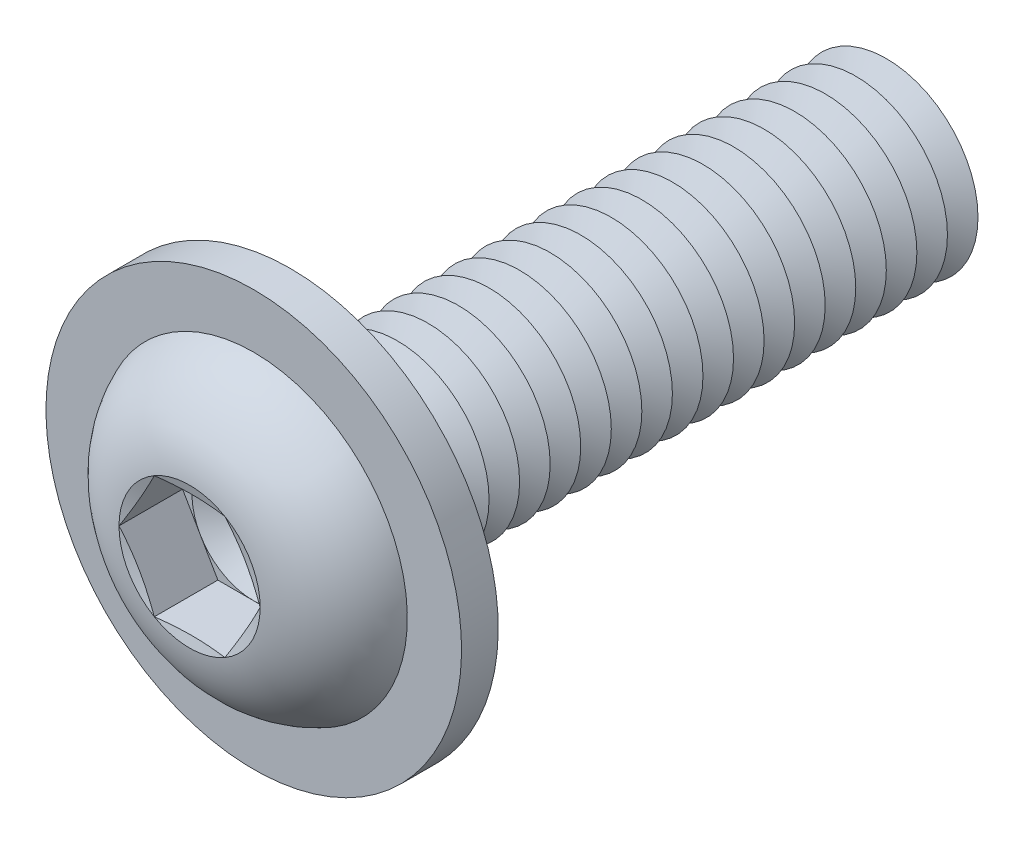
from build123d import *

# Parameters (mm, degrees)
FILLET1_R           = 0.5
LPATTERN1_COUNT     = 20
LPATTERN1_PITCH     = 1
CUT_EXTRUDE1_DEPTH  = 2.08
SKETCH5_R           = 6.8
SKETCH5_R_2         = 3.5
BOSS_EXTRUDE1_DEPTH = 1.2


with BuildPart() as part:
    # Sketch1 → Revolve1 (revolve)
    with BuildSketch(Plane(origin=(0, 0, 0), x_dir=(0, 0, -1), z_dir=(1, 0, 0)), mode=Mode.PRIVATE) as revolve1_sk:
        with BuildLine():
            Line((0, 3), (0, 5.25))
            ThreePointArc((0, 5.25), (-2.210041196, 4.408189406), (-3.3, 2.3094))
            Line((-3.3, 2.3094), (-2.990599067, 1.1547))
            Line((-2.990599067, 1.1547), (-3.3, 1.1547))
            Line((-3.3, 1.1547), (-3.3, 0))
            Line((-3.3, 0), (20, 0))
            Line((20, 0), (20, 3))
            Line((20, 3), (0, 3))
        make_face()
    revolve(revolve1_sk.sketch.rotate(Axis((0, 0, -20), (0, 0, 1)), 90), axis=Axis((0, 0, -20), (0, 0, 1)))

    # Fillet1
    fillet1_edges = [part.edges().sort_by_distance(p)[0] for p in [
        (3, 0, 0),
    ]]
    fillet(fillet1_edges, radius=FILLET1_R)

    # Sketch2 → Cut-Revolve1 (revolve, cut)
    with BuildSketch(Plane(origin=(0, 0, 0), x_dir=(0, 0, -1), z_dir=(1, 0, 0)), mode=Mode.PRIVATE) as cut_revolve1_sk:
        Polygon((19.5, 3), (20.5, 3), (20, 2.133974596), align=None)
    cut_revolve1 = revolve(cut_revolve1_sk.sketch.rotate(Axis((0, 0, -20), (0, 0, -1)), 270), axis=Axis((0, 0, -20), (0, 0, -1)), mode=Mode.SUBTRACT)

    # LPattern1: Cut-Revolve1 ×20
    with Locations(*[(0, 0, i * LPATTERN1_PITCH) for i in range(1, LPATTERN1_COUNT)]):
        add(cut_revolve1, mode=Mode.SUBTRACT)

    # Sketch3 → Cut-Extrude1 (cut)
    with BuildSketch(Plane.XY.offset(3.3)):
        Polygon((1.1547, 1.999999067), (-1.1547, 1.999999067), (-2.3094, 0), (-1.1547, -1.999999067), (1.1547, -1.999999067), (2.3094, 0), align=None)
    extrude(amount=-CUT_EXTRUDE1_DEPTH, mode=Mode.SUBTRACT)

    # Cut-Extrude2 cone 1 section (on through the dimple's axis) → Cut-Extrude2 (revolve, cut)
    with BuildSketch(Plane(origin=(0, 0, 1.22), x_dir=(0, -1, 0), z_dir=(1, 0, 0))):
        Polygon((0, 0), (1.999999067, 0), (0, 1.1547), align=None)
    revolve(axis=Axis((0, 0, 1.22), (0, 0, -1)), mode=Mode.SUBTRACT)

    # Sketch5 → Boss-Extrude1 (add)
    with BuildSketch(Plane(origin=(0, 0, 0), x_dir=(-1, 0, 0), z_dir=(0, 0, -1))):
        with Locations(Location((0, 0, 0), (0, 0, 90))):
            Circle(SKETCH5_R)
        Circle(SKETCH5_R_2, mode=Mode.SUBTRACT)
    extrude(amount=-BOSS_EXTRUDE1_DEPTH)


solid = part.part
